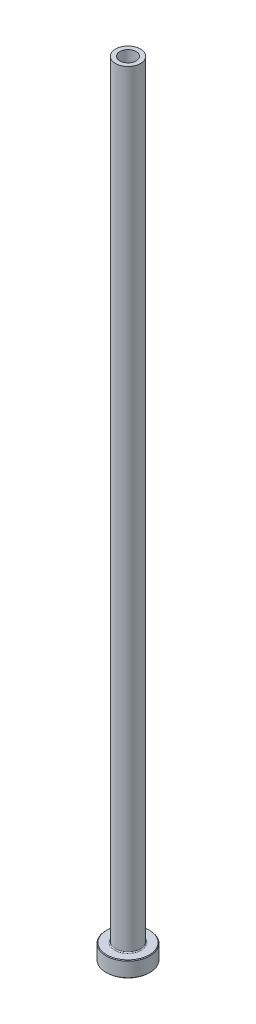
from build123d import *

# Parameters (mm, degrees)
FILLET1_R     = 0.3
CHAMFER1_SIZE = 0.2
CHAMFER3_SIZE = 0.5


with BuildPart() as part:
    # Sketch1 → Revolve1 (revolve)
    with BuildSketch(Plane.XY, mode=Mode.PRIVATE) as revolve1_sk:
        Polygon((-2.6, 250), (-4, 250), (-4, 5), (-7, 5), (-7, 0), (-2.85, 0), (-2.85, 193), (-2.6, 205), align=None)
    revolve(revolve1_sk.sketch.rotate(Axis((0, 92.187680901, 0), (0, -1, 0)), 270), axis=Axis((0, 92.187680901, 0), (0, -1, 0)))

    # Fillet1
    fillet1_edges = [part.edges().sort_by_distance(p)[0] for p in [
        (0, 5, -4),
    ]]
    fillet(fillet1_edges, radius=FILLET1_R)

    # Chamfer1
    chamfer1_edges = [part.edges().sort_by_distance(p)[0] for p in [
        (0, 0, -7),
        (0, 5, -7),
    ]]
    chamfer(chamfer1_edges, length=CHAMFER1_SIZE)

    # Chamfer3
    chamfer3_edges = [part.edges().sort_by_distance(p)[0] for p in [
        (0, 0, -2.85),
    ]]
    chamfer(chamfer3_edges, length=CHAMFER3_SIZE)


solid = part.part
